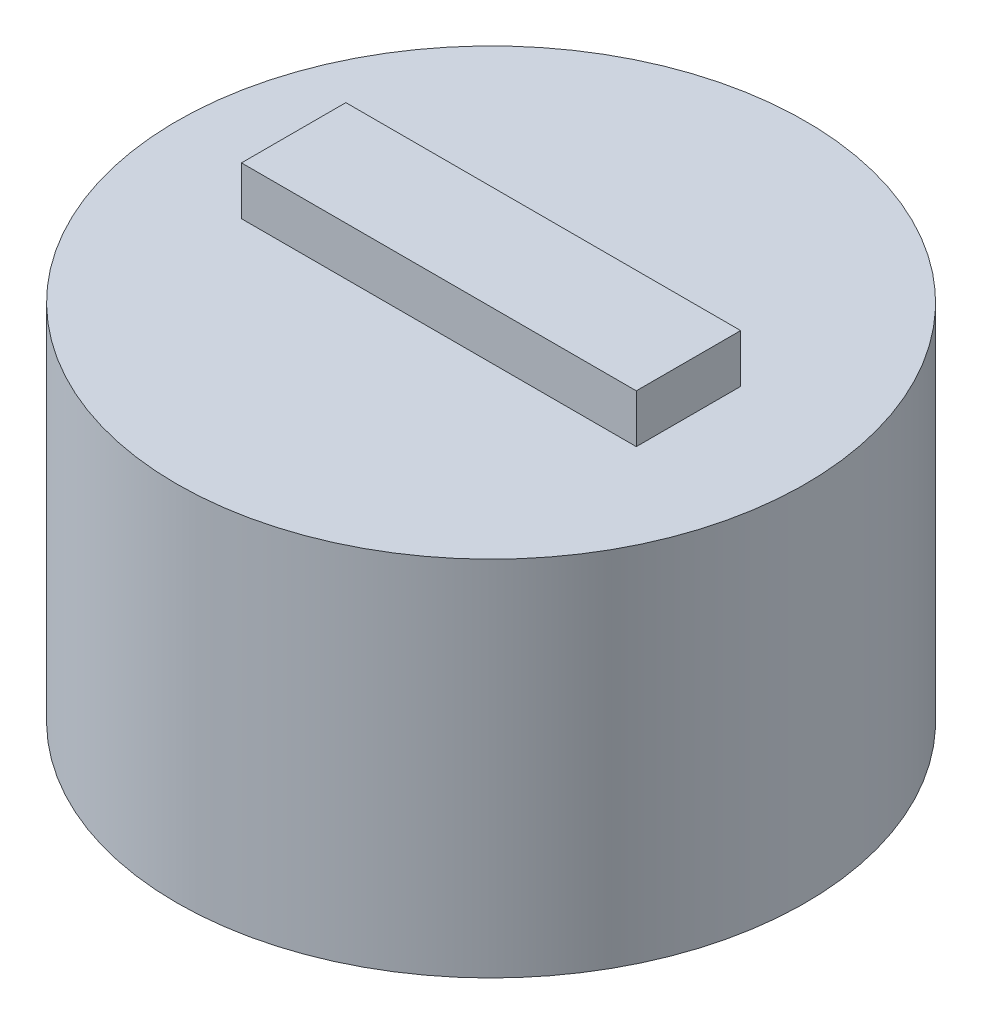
ISO-10303-21;
HEADER;
FILE_DESCRIPTION(('STEP AP214'),'2;1');
FILE_NAME('part.step','',(''),(''),'','','');
FILE_SCHEMA(('AUTOMOTIVE_DESIGN { 1 0 10303 214 1 1 1 1 }'));
ENDSEC;
DATA;
#1=APPLICATION_CONTEXT('core data for automotive mechanical design processes');
#2=APPLICATION_PROTOCOL_DEFINITION('international standard','automotive_design',2000,#1);
#3=PRODUCT_CONTEXT('',#1,'mechanical');
#4=PRODUCT('Part','Part','',(#3));
#5=PRODUCT_RELATED_PRODUCT_CATEGORY('part','',(#4));
#6=PRODUCT_DEFINITION_FORMATION('','',#4);
#7=PRODUCT_DEFINITION_CONTEXT('part definition',#1,'design');
#8=PRODUCT_DEFINITION('design','',#6,#7);
#9=PRODUCT_DEFINITION_SHAPE('','',#8);
#10=(LENGTH_UNIT() NAMED_UNIT(*) SI_UNIT(.MILLI.,.METRE.));
#11=(NAMED_UNIT(*) PLANE_ANGLE_UNIT() SI_UNIT($,.RADIAN.));
#12=(NAMED_UNIT(*) SI_UNIT($,.STERADIAN.) SOLID_ANGLE_UNIT());
#13=UNCERTAINTY_MEASURE_WITH_UNIT(LENGTH_MEASURE(1.E-05),#10,'distance_accuracy_value','');
#14=(GEOMETRIC_REPRESENTATION_CONTEXT(3) GLOBAL_UNCERTAINTY_ASSIGNED_CONTEXT((#13)) GLOBAL_UNIT_ASSIGNED_CONTEXT((#10,
#11,#12)) REPRESENTATION_CONTEXT('',''));
#15=CARTESIAN_POINT('',(0.,0.,0.));
#16=DIRECTION('',(0.,0.,1.));
#17=DIRECTION('',(1.,0.,0.));
#18=AXIS2_PLACEMENT_3D('',#15,#16,#17);
#19=CARTESIAN_POINT('',(0.,75.,0.));
#20=DIRECTION('',(0.,1.,0.));
#21=DIRECTION('',(0.,0.,1.));
#22=AXIS2_PLACEMENT_3D('',#19,#20,#21);
#23=PLANE('',#22);
#24=CARTESIAN_POINT('',(0.,75.,0.));
#25=DIRECTION('',(0.,1.,0.));
#26=DIRECTION('',(0.,0.,1.));
#27=AXIS2_PLACEMENT_3D('',#24,#25,#26);
#28=CIRCLE('',#27,65.);
#29=CARTESIAN_POINT('',(0.,75.,65.));
#30=VERTEX_POINT('',#29);
#31=EDGE_CURVE('E112',#30,#30,#28,.T.);
#32=ORIENTED_EDGE('',*,*,#31,.T.);
#33=EDGE_LOOP('',(#32));
#34=FACE_BOUND('',#33,.T.);
#35=DIRECTION('',(1.,0.,0.));
#36=VECTOR('',#35,1.);
#37=CARTESIAN_POINT('',(40.8203956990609,75.,10.7904287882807));
#38=LINE('',#37,#36);
#39=CARTESIAN_POINT('',(-40.8203956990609,75.,10.7904287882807));
#40=VERTEX_POINT('',#39);
#41=CARTESIAN_POINT('',(40.8203956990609,75.,10.7904287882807));
#42=VERTEX_POINT('',#41);
#43=EDGE_CURVE('E91',#40,#42,#38,.T.);
#44=ORIENTED_EDGE('',*,*,#43,.F.);
#45=DIRECTION('',(0.,0.,1.));
#46=VECTOR('',#45,1.);
#47=CARTESIAN_POINT('',(-40.8203956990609,75.,10.7904287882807));
#48=LINE('',#47,#46);
#49=CARTESIAN_POINT('',(-40.8203956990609,75.,-10.7904287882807));
#50=VERTEX_POINT('',#49);
#51=EDGE_CURVE('E102',#50,#40,#48,.T.);
#52=ORIENTED_EDGE('',*,*,#51,.F.);
#53=DIRECTION('',(-1.,0.,0.));
#54=VECTOR('',#53,1.);
#55=CARTESIAN_POINT('',(40.8203956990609,75.,-10.7904287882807));
#56=LINE('',#55,#54);
#57=CARTESIAN_POINT('',(40.8203956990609,75.,-10.7904287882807));
#58=VERTEX_POINT('',#57);
#59=EDGE_CURVE('E72',#58,#50,#56,.T.);
#60=ORIENTED_EDGE('',*,*,#59,.F.);
#61=DIRECTION('',(0.,0.,-1.));
#62=VECTOR('',#61,1.);
#63=CARTESIAN_POINT('',(40.8203956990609,75.,10.7904287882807));
#64=LINE('',#63,#62);
#65=EDGE_CURVE('E106',#42,#58,#64,.T.);
#66=ORIENTED_EDGE('',*,*,#65,.F.);
#67=EDGE_LOOP('',(#44,#52,#60,#66));
#68=FACE_BOUND('',#67,.T.);
#69=ADVANCED_FACE('F34',(#34,#68),#23,.T.);
#70=CARTESIAN_POINT('',(0.,0.,0.));
#71=DIRECTION('',(0.,1.,0.));
#72=DIRECTION('',(0.,0.,1.));
#73=AXIS2_PLACEMENT_3D('',#70,#71,#72);
#74=PLANE('',#73);
#75=CARTESIAN_POINT('',(0.,0.,0.));
#76=DIRECTION('',(0.,1.,0.));
#77=DIRECTION('',(0.,0.,1.));
#78=AXIS2_PLACEMENT_3D('',#75,#76,#77);
#79=CIRCLE('',#78,65.);
#80=CARTESIAN_POINT('',(0.,0.,65.));
#81=VERTEX_POINT('',#80);
#82=EDGE_CURVE('E11',#81,#81,#79,.T.);
#83=ORIENTED_EDGE('',*,*,#82,.F.);
#84=EDGE_LOOP('',(#83));
#85=FACE_BOUND('',#84,.T.);
#86=ADVANCED_FACE('F142',(#85),#74,.F.);
#87=CARTESIAN_POINT('',(0.,70.,0.));
#88=DIRECTION('',(0.,-1.,0.));
#89=DIRECTION('',(0.,0.,-1.));
#90=AXIS2_PLACEMENT_3D('',#87,#88,#89);
#91=CYLINDRICAL_SURFACE('',#90,65.);
#92=ORIENTED_EDGE('',*,*,#82,.T.);
#93=EDGE_LOOP('',(#92));
#94=FACE_BOUND('',#93,.T.);
#95=ORIENTED_EDGE('',*,*,#31,.F.);
#96=EDGE_LOOP('',(#95));
#97=FACE_BOUND('',#96,.T.);
#98=ADVANCED_FACE('F36',(#94,#97),#91,.T.);
#99=CARTESIAN_POINT('',(-40.8203956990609,85.,10.7904287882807));
#100=DIRECTION('',(1.,0.,0.));
#101=DIRECTION('',(0.,0.,-1.));
#102=AXIS2_PLACEMENT_3D('',#99,#100,#101);
#103=PLANE('',#102);
#104=ORIENTED_EDGE('',*,*,#51,.T.);
#105=DIRECTION('',(0.,-1.,0.));
#106=VECTOR('',#105,1.);
#107=CARTESIAN_POINT('',(-40.8203956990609,85.,10.7904287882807));
#108=LINE('',#107,#106);
#109=CARTESIAN_POINT('',(-40.8203956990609,85.,10.7904287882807));
#110=VERTEX_POINT('',#109);
#111=EDGE_CURVE('E94',#110,#40,#108,.T.);
#112=ORIENTED_EDGE('',*,*,#111,.F.);
#113=DIRECTION('',(0.,0.,1.));
#114=VECTOR('',#113,1.);
#115=CARTESIAN_POINT('',(-40.8203956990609,85.,10.7904287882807));
#116=LINE('',#115,#114);
#117=CARTESIAN_POINT('',(-40.8203956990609,85.,-10.7904287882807));
#118=VERTEX_POINT('',#117);
#119=EDGE_CURVE('E84',#118,#110,#116,.T.);
#120=ORIENTED_EDGE('',*,*,#119,.F.);
#121=DIRECTION('',(0.,-1.,0.));
#122=VECTOR('',#121,1.);
#123=CARTESIAN_POINT('',(-40.8203956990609,85.,-10.7904287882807));
#124=LINE('',#123,#122);
#125=EDGE_CURVE('E98',#118,#50,#124,.T.);
#126=ORIENTED_EDGE('',*,*,#125,.T.);
#127=EDGE_LOOP('',(#104,#112,#120,#126));
#128=FACE_BOUND('',#127,.T.);
#129=ADVANCED_FACE('F147',(#128),#103,.F.);
#130=CARTESIAN_POINT('',(40.8203956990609,85.,10.7904287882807));
#131=DIRECTION('',(0.,0.,-1.));
#132=DIRECTION('',(-1.,0.,0.));
#133=AXIS2_PLACEMENT_3D('',#130,#131,#132);
#134=PLANE('',#133);
#135=ORIENTED_EDGE('',*,*,#43,.T.);
#136=DIRECTION('',(0.,-1.,0.));
#137=VECTOR('',#136,1.);
#138=CARTESIAN_POINT('',(40.8203956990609,85.,10.7904287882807));
#139=LINE('',#138,#137);
#140=CARTESIAN_POINT('',(40.8203956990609,85.,10.7904287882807));
#141=VERTEX_POINT('',#140);
#142=EDGE_CURVE('E88',#141,#42,#139,.T.);
#143=ORIENTED_EDGE('',*,*,#142,.F.);
#144=DIRECTION('',(1.,0.,0.));
#145=VECTOR('',#144,1.);
#146=CARTESIAN_POINT('',(40.8203956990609,85.,10.7904287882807));
#147=LINE('',#146,#145);
#148=EDGE_CURVE('E79',#110,#141,#147,.T.);
#149=ORIENTED_EDGE('',*,*,#148,.F.);
#150=ORIENTED_EDGE('',*,*,#111,.T.);
#151=EDGE_LOOP('',(#135,#143,#149,#150));
#152=FACE_BOUND('',#151,.T.);
#153=ADVANCED_FACE('F89',(#152),#134,.F.);
#154=CARTESIAN_POINT('',(40.8203956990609,85.,10.7904287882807));
#155=DIRECTION('',(-1.,0.,0.));
#156=DIRECTION('',(0.,0.,1.));
#157=AXIS2_PLACEMENT_3D('',#154,#155,#156);
#158=PLANE('',#157);
#159=ORIENTED_EDGE('',*,*,#65,.T.);
#160=DIRECTION('',(0.,-1.,0.));
#161=VECTOR('',#160,1.);
#162=CARTESIAN_POINT('',(40.8203956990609,85.,-10.7904287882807));
#163=LINE('',#162,#161);
#164=CARTESIAN_POINT('',(40.8203956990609,85.,-10.7904287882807));
#165=VERTEX_POINT('',#164);
#166=EDGE_CURVE('E50',#165,#58,#163,.T.);
#167=ORIENTED_EDGE('',*,*,#166,.F.);
#168=DIRECTION('',(0.,0.,-1.));
#169=VECTOR('',#168,1.);
#170=CARTESIAN_POINT('',(40.8203956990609,85.,10.7904287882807));
#171=LINE('',#170,#169);
#172=EDGE_CURVE('E82',#141,#165,#171,.T.);
#173=ORIENTED_EDGE('',*,*,#172,.F.);
#174=ORIENTED_EDGE('',*,*,#142,.T.);
#175=EDGE_LOOP('',(#159,#167,#173,#174));
#176=FACE_BOUND('',#175,.T.);
#177=ADVANCED_FACE('F96',(#176),#158,.F.);
#178=CARTESIAN_POINT('',(40.8203956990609,85.,-10.7904287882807));
#179=DIRECTION('',(0.,0.,1.));
#180=DIRECTION('',(1.,0.,0.));
#181=AXIS2_PLACEMENT_3D('',#178,#179,#180);
#182=PLANE('',#181);
#183=ORIENTED_EDGE('',*,*,#59,.T.);
#184=ORIENTED_EDGE('',*,*,#125,.F.);
#185=DIRECTION('',(-1.,0.,0.));
#186=VECTOR('',#185,1.);
#187=CARTESIAN_POINT('',(40.8203956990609,85.,-10.7904287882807));
#188=LINE('',#187,#186);
#189=EDGE_CURVE('E58',#165,#118,#188,.T.);
#190=ORIENTED_EDGE('',*,*,#189,.F.);
#191=ORIENTED_EDGE('',*,*,#166,.T.);
#192=EDGE_LOOP('',(#183,#184,#190,#191));
#193=FACE_BOUND('',#192,.T.);
#194=ADVANCED_FACE('F158',(#193),#182,.F.);
#195=CARTESIAN_POINT('',(0.,85.,0.));
#196=DIRECTION('',(0.,1.,0.));
#197=DIRECTION('',(0.,0.,1.));
#198=AXIS2_PLACEMENT_3D('',#195,#196,#197);
#199=PLANE('',#198);
#200=ORIENTED_EDGE('',*,*,#119,.T.);
#201=ORIENTED_EDGE('',*,*,#148,.T.);
#202=ORIENTED_EDGE('',*,*,#172,.T.);
#203=ORIENTED_EDGE('',*,*,#189,.T.);
#204=EDGE_LOOP('',(#200,#201,#202,#203));
#205=FACE_BOUND('',#204,.T.);
#206=ADVANCED_FACE('F80',(#205),#199,.T.);
#207=CLOSED_SHELL('',(#69,#86,#98,#129,#153,#177,#194,#206));
#208=CARTESIAN_POINT('',(0.,70.,0.));
#209=DIRECTION('',(0.,-1.,0.));
#210=DIRECTION('',(0.,0.,-1.));
#211=AXIS2_PLACEMENT_3D('',#208,#209,#210);
#212=CYLINDRICAL_SURFACE('',#211,60.);
#213=CARTESIAN_POINT('',(0.,70.,0.));
#214=DIRECTION('',(0.,1.,0.));
#215=DIRECTION('',(0.,0.,1.));
#216=AXIS2_PLACEMENT_3D('',#213,#214,#215);
#217=CIRCLE('',#216,60.);
#218=CARTESIAN_POINT('',(0.,70.,60.));
#219=VERTEX_POINT('',#218);
#220=EDGE_CURVE('E115',#219,#219,#217,.T.);
#221=ORIENTED_EDGE('',*,*,#220,.T.);
#222=EDGE_LOOP('',(#221));
#223=FACE_BOUND('',#222,.T.);
#224=CARTESIAN_POINT('',(0.,5.,0.));
#225=DIRECTION('',(0.,1.,0.));
#226=DIRECTION('',(0.,0.,1.));
#227=AXIS2_PLACEMENT_3D('',#224,#225,#226);
#228=CIRCLE('',#227,60.);
#229=CARTESIAN_POINT('',(0.,5.,60.));
#230=VERTEX_POINT('',#229);
#231=EDGE_CURVE('E43',#230,#230,#228,.T.);
#232=ORIENTED_EDGE('',*,*,#231,.F.);
#233=EDGE_LOOP('',(#232));
#234=FACE_BOUND('',#233,.T.);
#235=ADVANCED_FACE('F128',(#223,#234),#212,.F.);
#236=CARTESIAN_POINT('',(0.,5.,0.));
#237=DIRECTION('',(0.,1.,0.));
#238=DIRECTION('',(0.,0.,1.));
#239=AXIS2_PLACEMENT_3D('',#236,#237,#238);
#240=PLANE('',#239);
#241=CARTESIAN_POINT('',(0.,5.,0.));
#242=DIRECTION('',(0.,1.,0.));
#243=DIRECTION('',(0.,0.,1.));
#244=AXIS2_PLACEMENT_3D('',#241,#242,#243);
#245=CIRCLE('',#244,25.);
#246=CARTESIAN_POINT('',(0.,5.,25.));
#247=VERTEX_POINT('',#246);
#248=EDGE_CURVE('E118',#247,#247,#245,.T.);
#249=ORIENTED_EDGE('',*,*,#248,.F.);
#250=EDGE_LOOP('',(#249));
#251=FACE_BOUND('',#250,.T.);
#252=ORIENTED_EDGE('',*,*,#231,.T.);
#253=EDGE_LOOP('',(#252));
#254=FACE_BOUND('',#253,.T.);
#255=ADVANCED_FACE('F126',(#251,#254),#240,.T.);
#256=CARTESIAN_POINT('',(0.,40.,0.));
#257=DIRECTION('',(0.,-1.,0.));
#258=DIRECTION('',(0.,0.,-1.));
#259=AXIS2_PLACEMENT_3D('',#256,#257,#258);
#260=CYLINDRICAL_SURFACE('',#259,25.);
#261=CARTESIAN_POINT('',(0.,40.,0.));
#262=DIRECTION('',(0.,1.,0.));
#263=DIRECTION('',(0.,0.,1.));
#264=AXIS2_PLACEMENT_3D('',#261,#262,#263);
#265=CIRCLE('',#264,25.);
#266=CARTESIAN_POINT('',(0.,40.,25.));
#267=VERTEX_POINT('',#266);
#268=EDGE_CURVE('E119',#267,#267,#265,.T.);
#269=ORIENTED_EDGE('',*,*,#268,.F.);
#270=EDGE_LOOP('',(#269));
#271=FACE_BOUND('',#270,.T.);
#272=ORIENTED_EDGE('',*,*,#248,.T.);
#273=EDGE_LOOP('',(#272));
#274=FACE_BOUND('',#273,.T.);
#275=ADVANCED_FACE('F137',(#271,#274),#260,.T.);
#276=CARTESIAN_POINT('',(0.,40.,0.));
#277=DIRECTION('',(0.,1.,0.));
#278=DIRECTION('',(0.,0.,1.));
#279=AXIS2_PLACEMENT_3D('',#276,#277,#278);
#280=PLANE('',#279);
#281=ORIENTED_EDGE('',*,*,#268,.T.);
#282=EDGE_LOOP('',(#281));
#283=FACE_BOUND('',#282,.T.);
#284=ADVANCED_FACE('F174',(#283),#280,.T.);
#285=CARTESIAN_POINT('',(0.,70.,0.));
#286=DIRECTION('',(0.,1.,0.));
#287=DIRECTION('',(0.,0.,1.));
#288=AXIS2_PLACEMENT_3D('',#285,#286,#287);
#289=PLANE('',#288);
#290=ORIENTED_EDGE('',*,*,#220,.F.);
#291=EDGE_LOOP('',(#290));
#292=FACE_BOUND('',#291,.T.);
#293=ADVANCED_FACE('F172',(#292),#289,.F.);
#294=CLOSED_SHELL('',(#235,#255,#275,#284,#293));
#295=ORIENTED_CLOSED_SHELL('',*,#294,.T.);
#296=BREP_WITH_VOIDS('B2',#207,(#295));
#297=ADVANCED_BREP_SHAPE_REPRESENTATION('',(#18,#296),#14);
#298=SHAPE_DEFINITION_REPRESENTATION(#9,#297);
ENDSEC;
END-ISO-10303-21;
